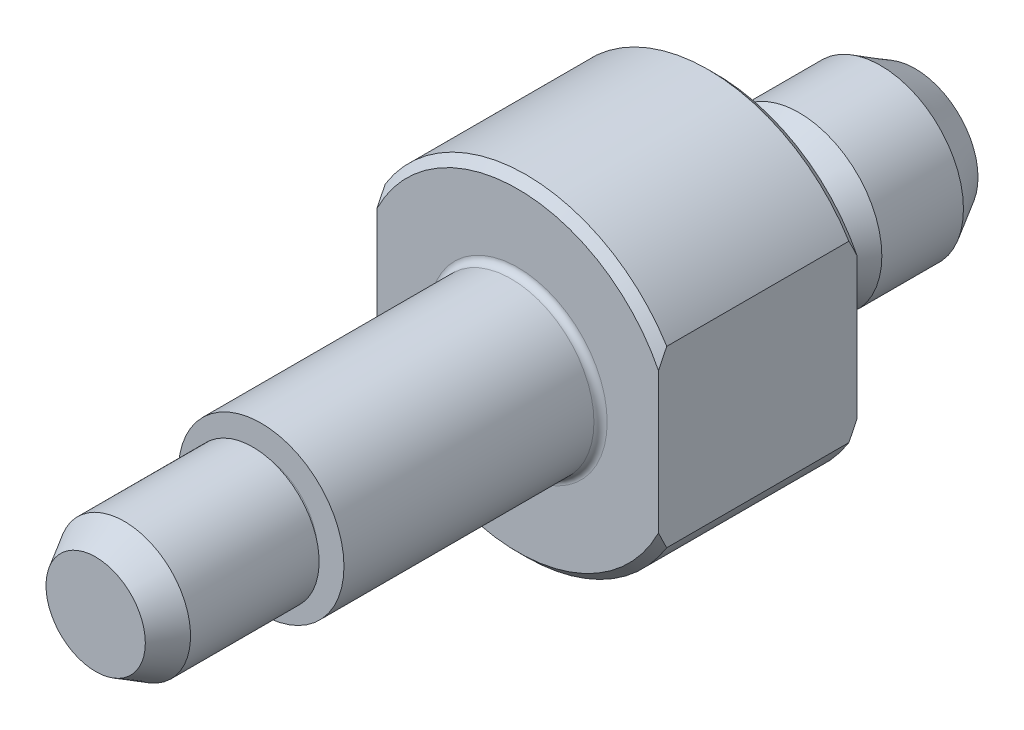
ISO-10303-21;
HEADER;
FILE_DESCRIPTION(('STEP AP214'),'2;1');
FILE_NAME('part.step','',(''),(''),'','','');
FILE_SCHEMA(('AUTOMOTIVE_DESIGN { 1 0 10303 214 1 1 1 1 }'));
ENDSEC;
DATA;
#1=APPLICATION_CONTEXT('core data for automotive mechanical design processes');
#2=APPLICATION_PROTOCOL_DEFINITION('international standard','automotive_design',2000,#1);
#3=PRODUCT_CONTEXT('',#1,'mechanical');
#4=PRODUCT('Part','Part','',(#3));
#5=PRODUCT_RELATED_PRODUCT_CATEGORY('part','',(#4));
#6=PRODUCT_DEFINITION_FORMATION('','',#4);
#7=PRODUCT_DEFINITION_CONTEXT('part definition',#1,'design');
#8=PRODUCT_DEFINITION('design','',#6,#7);
#9=PRODUCT_DEFINITION_SHAPE('','',#8);
#10=(LENGTH_UNIT() NAMED_UNIT(*) SI_UNIT(.MILLI.,.METRE.));
#11=(NAMED_UNIT(*) PLANE_ANGLE_UNIT() SI_UNIT($,.RADIAN.));
#12=(NAMED_UNIT(*) SI_UNIT($,.STERADIAN.) SOLID_ANGLE_UNIT());
#13=UNCERTAINTY_MEASURE_WITH_UNIT(LENGTH_MEASURE(1.E-05),#10,'distance_accuracy_value','');
#14=(GEOMETRIC_REPRESENTATION_CONTEXT(3) GLOBAL_UNCERTAINTY_ASSIGNED_CONTEXT((#13)) GLOBAL_UNIT_ASSIGNED_CONTEXT((#10,
#11,#12)) REPRESENTATION_CONTEXT('',''));
#15=CARTESIAN_POINT('',(0.,0.,0.));
#16=DIRECTION('',(0.,0.,1.));
#17=DIRECTION('',(1.,0.,0.));
#18=AXIS2_PLACEMENT_3D('',#15,#16,#17);
#19=CARTESIAN_POINT('',(0.,4.25000000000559,0.));
#20=DIRECTION('',(0.,0.,1.));
#21=DIRECTION('',(1.,0.,0.));
#22=AXIS2_PLACEMENT_3D('',#19,#20,#21);
#23=PLANE('',#22);
#24=CARTESIAN_POINT('',(0.,0.,0.));
#25=DIRECTION('',(0.,0.,1.));
#26=DIRECTION('',(1.,0.,0.));
#27=AXIS2_PLACEMENT_3D('',#24,#25,#26);
#28=CIRCLE('',#27,4.25000000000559);
#29=CARTESIAN_POINT('',(4.25000000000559,0.,0.));
#30=VERTEX_POINT('',#29);
#31=EDGE_CURVE('E114',#30,#30,#28,.T.);
#32=ORIENTED_EDGE('',*,*,#31,.T.);
#33=EDGE_LOOP('',(#32));
#34=FACE_BOUND('',#33,.T.);
#35=DIRECTION('',(0.,1.,0.));
#36=VECTOR('',#35,1.);
#37=CARTESIAN_POINT('',(-8.5,5.26782687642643,0.));
#38=LINE('',#37,#36);
#39=CARTESIAN_POINT('',(-8.5,-4.24264068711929,0.));
#40=VERTEX_POINT('',#39);
#41=CARTESIAN_POINT('',(-8.5,4.24264068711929,0.));
#42=VERTEX_POINT('',#41);
#43=EDGE_CURVE('E151',#40,#42,#38,.T.);
#44=ORIENTED_EDGE('',*,*,#43,.T.);
#45=CARTESIAN_POINT('',(0.,0.,0.));
#46=DIRECTION('',(0.,0.,1.));
#47=DIRECTION('',(1.,0.,0.));
#48=AXIS2_PLACEMENT_3D('',#45,#46,#47);
#49=CIRCLE('',#48,9.5);
#50=CARTESIAN_POINT('',(8.5,4.24264068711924,0.));
#51=VERTEX_POINT('',#50);
#52=EDGE_CURVE('E111',#51,#42,#49,.T.);
#53=ORIENTED_EDGE('',*,*,#52,.F.);
#54=DIRECTION('',(0.,-1.,0.));
#55=VECTOR('',#54,1.);
#56=CARTESIAN_POINT('',(8.5,5.26782687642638,0.));
#57=LINE('',#56,#55);
#58=CARTESIAN_POINT('',(8.5,-4.24264068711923,0.));
#59=VERTEX_POINT('',#58);
#60=EDGE_CURVE('E156',#51,#59,#57,.T.);
#61=ORIENTED_EDGE('',*,*,#60,.T.);
#62=EDGE_CURVE('E110',#40,#59,#49,.T.);
#63=ORIENTED_EDGE('',*,*,#62,.F.);
#64=EDGE_LOOP('',(#44,#53,#61,#63));
#65=FACE_BOUND('',#64,.T.);
#66=ADVANCED_FACE('F14',(#34,#65),#23,.F.);
#67=CARTESIAN_POINT('',(0.,0.,0.));
#68=DIRECTION('',(0.,0.,1.));
#69=DIRECTION('',(1.,0.,0.));
#70=AXIS2_PLACEMENT_3D('',#67,#68,#69);
#71=CONICAL_SURFACE('',#70,9.5,0.785398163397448);
#72=CARTESIAN_POINT('',(-8.5,-0.37272096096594,-0.991832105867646));
#73=CARTESIAN_POINT('',(-8.5,-0.507917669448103,-0.985925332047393));
#74=CARTESIAN_POINT('',(-8.5,-0.642962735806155,-0.976777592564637));
#75=CARTESIAN_POINT('',(-8.5,-0.912452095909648,-0.952214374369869));
#76=CARTESIAN_POINT('',(-8.5,-1.04689651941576,-0.936800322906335));
#77=CARTESIAN_POINT('',(-8.5,-1.31472326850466,-0.899946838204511));
#78=CARTESIAN_POINT('',(-8.5,-1.44810700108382,-0.878517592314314));
#79=CARTESIAN_POINT('',(-8.5,-1.7138236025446,-0.829929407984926));
#80=CARTESIAN_POINT('',(-8.5,-1.8461564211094,-0.802770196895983));
#81=CARTESIAN_POINT('',(-8.5,-2.23843819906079,-0.713859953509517));
#82=CARTESIAN_POINT('',(-8.5,-2.49663193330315,-0.644254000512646));
#83=CARTESIAN_POINT('',(-8.5,-3.00738161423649,-0.486941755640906));
#84=CARTESIAN_POINT('',(-8.5,-3.25993706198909,-0.399233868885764));
#85=CARTESIAN_POINT('',(-8.5,-3.60633087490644,-0.267035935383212));
#86=CARTESIAN_POINT('',(-8.5,-3.70267067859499,-0.228964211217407));
#87=CARTESIAN_POINT('',(-8.5,-3.84660031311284,-0.170240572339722));
#88=CARTESIAN_POINT('',(-8.5,-3.89451322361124,-0.150382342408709));
#89=CARTESIAN_POINT('',(-8.5,-3.9901211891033,-0.110155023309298));
#90=CARTESIAN_POINT('',(-8.5,-4.03781625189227,-0.0897859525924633));
#91=CARTESIAN_POINT('',(-8.5,-4.41902106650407,0.0753473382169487));
#92=CARTESIAN_POINT('',(-8.5,-4.74745851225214,0.231964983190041));
#93=CARTESIAN_POINT('',(-8.5,-5.39492011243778,0.563687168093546));
#94=CARTESIAN_POINT('',(-8.5,-5.71393853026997,0.738802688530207));
#95=CARTESIAN_POINT('',(-8.5,-6.34473897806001,1.10374280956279));
#96=CARTESIAN_POINT('',(-8.5,-6.65649518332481,1.29361180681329));
#97=CARTESIAN_POINT('',(-8.5,-7.27292769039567,1.68430487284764));
#98=CARTESIAN_POINT('',(-8.5,-7.57760543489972,1.88512668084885));
#99=CARTESIAN_POINT('',(-8.5,-8.17594813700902,2.29189718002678));
#100=CARTESIAN_POINT('',(-8.5,-8.46971226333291,2.49770061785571));
#101=CARTESIAN_POINT('',(-8.5,-9.05248286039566,2.91597018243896));
#102=CARTESIAN_POINT('',(-8.5,-9.34148890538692,3.12843690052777));
#103=CARTESIAN_POINT('',(-8.5,-9.91326520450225,3.5570756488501));
#104=CARTESIAN_POINT('',(-8.5,-10.1960663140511,3.77320664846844));
#105=CARTESIAN_POINT('',(-8.5,-10.7582100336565,4.20978238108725));
#106=CARTESIAN_POINT('',(-8.5,-11.0375534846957,4.43022603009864));
#107=CARTESIAN_POINT('',(-8.5,-11.3154929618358,4.6523984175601));
#108=B_SPLINE_CURVE_WITH_KNOTS('',3,(#72,#73,#74,#75,#76,#77,#78,#79,#80,#81,#82,#83,#84,#85,
#86,#87,#88,#89,#90,#91,#92,#93,#94,#95,#96,#97,#98,#99,#100,#101,#102,#103,#104,#105,#106,
#107),.UNSPECIFIED.,.F.,.F.,(4,2,2,2,2,2,2,2,2,2,2,2,2,2,2,2,2,4),(0.,0.405923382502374,
0.811754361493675,1.21690212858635,1.62206917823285,2.42345745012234,3.22491635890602,
3.53566783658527,3.69125965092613,3.84684585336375,4.93754201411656,6.02888929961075,
7.12365834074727,8.21820225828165,9.2941335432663,10.3701605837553,11.4379172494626,
12.5054088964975),.UNSPECIFIED.);
#109=CARTESIAN_POINT('',(-8.5,-5.26782687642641,0.5));
#110=VERTEX_POINT('',#109);
#111=EDGE_CURVE('E221',#40,#110,#108,.T.);
#112=ORIENTED_EDGE('',*,*,#111,.F.);
#113=ORIENTED_EDGE('',*,*,#62,.T.);
#114=CARTESIAN_POINT('',(8.5,-11.3154929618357,4.65239841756));
#115=CARTESIAN_POINT('',(8.5,-11.0292849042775,4.42362208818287));
#116=CARTESIAN_POINT('',(8.5,-10.7415906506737,4.19667337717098));
#117=CARTESIAN_POINT('',(8.5,-10.1625129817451,3.74737138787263));
#118=CARTESIAN_POINT('',(8.5,-9.8711285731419,3.52501939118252));
#119=CARTESIAN_POINT('',(8.5,-9.28190231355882,3.08432639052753));
#120=CARTESIAN_POINT('',(8.5,-8.98402837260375,2.86602815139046));
#121=CARTESIAN_POINT('',(8.5,-8.38316011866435,2.4366308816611));
#122=CARTESIAN_POINT('',(8.5,-8.08016629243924,2.22553117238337));
#123=CARTESIAN_POINT('',(8.5,-7.48054690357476,1.82085054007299));
#124=CARTESIAN_POINT('',(8.5,-7.18416758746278,1.62690623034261));
#125=CARTESIAN_POINT('',(8.5,-6.58465546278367,1.24957630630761));
#126=CARTESIAN_POINT('',(8.5,-6.28152157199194,1.06619240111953));
#127=CARTESIAN_POINT('',(8.5,-5.6681595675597,0.713482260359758));
#128=CARTESIAN_POINT('',(8.5,-5.35795159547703,0.544121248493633));
#129=CARTESIAN_POINT('',(8.5,-4.72861850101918,0.222995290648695));
#130=CARTESIAN_POINT('',(8.5,-4.40949735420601,0.0712226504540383));
#131=CARTESIAN_POINT('',(8.5,-3.79382756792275,-0.195479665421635));
#132=CARTESIAN_POINT('',(8.5,-3.49822614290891,-0.312577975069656));
#133=CARTESIAN_POINT('',(8.5,-2.89897602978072,-0.523606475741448));
#134=CARTESIAN_POINT('',(8.5,-2.59533481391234,-0.617557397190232));
#135=CARTESIAN_POINT('',(8.5,-2.13179685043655,-0.738050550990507));
#136=CARTESIAN_POINT('',(8.5,-1.97458059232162,-0.775031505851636));
#137=CARTESIAN_POINT('',(8.5,-1.65849610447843,-0.841089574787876));
#138=CARTESIAN_POINT('',(8.5,-1.49962804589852,-0.870167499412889));
#139=CARTESIAN_POINT('',(8.5,-1.17994467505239,-0.919948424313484));
#140=CARTESIAN_POINT('',(8.5,-1.01912419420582,-0.940618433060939));
#141=CARTESIAN_POINT('',(8.5,-0.696518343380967,-0.973029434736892));
#142=CARTESIAN_POINT('',(8.5,-0.534732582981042,-0.984766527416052));
#143=CARTESIAN_POINT('',(8.5,-0.372720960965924,-0.991832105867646));
#144=B_SPLINE_CURVE_WITH_KNOTS('',3,(#114,#115,#116,#117,#118,#119,#120,#121,#122,#123,#124,
#125,#126,#127,#128,#129,#130,#131,#132,#133,#134,#135,#136,#137,#138,#139,#140,#141,#142,#143),
.UNSPECIFIED.,.F.,.F.,(4,2,2,2,2,2,2,2,2,2,2,2,2,2,4),(0.,1.09924125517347,2.19878496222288,
3.30660143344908,4.41431316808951,5.47672807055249,6.53931443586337,7.5991813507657,
8.65858285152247,9.61170467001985,10.5639697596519,11.0483221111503,11.5326247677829,
12.0188098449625,12.5052070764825),.UNSPECIFIED.);
#145=CARTESIAN_POINT('',(8.5,-5.26782687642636,0.5));
#146=VERTEX_POINT('',#145);
#147=EDGE_CURVE('E197',#146,#59,#144,.T.);
#148=ORIENTED_EDGE('',*,*,#147,.F.);
#149=CARTESIAN_POINT('',(0.,0.,0.5));
#150=DIRECTION('',(0.,0.,1.));
#151=DIRECTION('',(1.,0.,0.));
#152=AXIS2_PLACEMENT_3D('',#149,#150,#151);
#153=CIRCLE('',#152,10.);
#154=EDGE_CURVE('E94',#110,#146,#153,.T.);
#155=ORIENTED_EDGE('',*,*,#154,.F.);
#156=EDGE_LOOP('',(#112,#113,#148,#155));
#157=FACE_BOUND('',#156,.T.);
#158=ADVANCED_FACE('F203',(#157),#71,.T.);
#159=CARTESIAN_POINT('',(-8.5,11.3154929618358,4.6523984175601));
#160=CARTESIAN_POINT('',(-8.5,11.0292849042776,4.42362208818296));
#161=CARTESIAN_POINT('',(-8.5,10.7415906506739,4.19667337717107));
#162=CARTESIAN_POINT('',(-8.5,10.1625129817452,3.74737138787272));
#163=CARTESIAN_POINT('',(-8.5,9.871128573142,3.5250193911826));
#164=CARTESIAN_POINT('',(-8.5,9.28190231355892,3.08432639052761));
#165=CARTESIAN_POINT('',(-8.5,8.98402837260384,2.86602815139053));
#166=CARTESIAN_POINT('',(-8.5,8.38316011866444,2.43663088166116));
#167=CARTESIAN_POINT('',(-8.5,8.08016629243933,2.22553117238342));
#168=CARTESIAN_POINT('',(-8.5,7.48054690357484,1.82085054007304));
#169=CARTESIAN_POINT('',(-8.5,7.18416758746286,1.62690623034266));
#170=CARTESIAN_POINT('',(-8.5,6.58465546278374,1.24957630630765));
#171=CARTESIAN_POINT('',(-8.5,6.281521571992,1.06619240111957));
#172=CARTESIAN_POINT('',(-8.5,5.66815956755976,0.71348226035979));
#173=CARTESIAN_POINT('',(-8.5,5.35795159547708,0.544121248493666));
#174=CARTESIAN_POINT('',(-8.5,4.72861850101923,0.222995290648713));
#175=CARTESIAN_POINT('',(-8.5,4.40949735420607,0.0712226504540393));
#176=CARTESIAN_POINT('',(-8.5,3.7938275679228,-0.195479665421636));
#177=CARTESIAN_POINT('',(-8.5,3.49822614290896,-0.312577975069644));
#178=CARTESIAN_POINT('',(-8.5,2.89897602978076,-0.52360647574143));
#179=CARTESIAN_POINT('',(-8.5,2.59533481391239,-0.617557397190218));
#180=CARTESIAN_POINT('',(-8.5,2.13179685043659,-0.738050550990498));
#181=CARTESIAN_POINT('',(-8.5,1.97458059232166,-0.775031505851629));
#182=CARTESIAN_POINT('',(-8.5,1.65849610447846,-0.841089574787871));
#183=CARTESIAN_POINT('',(-8.5,1.49962804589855,-0.870167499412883));
#184=CARTESIAN_POINT('',(-8.5,1.17994467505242,-0.919948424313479));
#185=CARTESIAN_POINT('',(-8.5,1.01912419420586,-0.940618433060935));
#186=CARTESIAN_POINT('',(-8.5,0.696518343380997,-0.973029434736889));
#187=CARTESIAN_POINT('',(-8.5,0.534732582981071,-0.98476652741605));
#188=CARTESIAN_POINT('',(-8.5,0.372720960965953,-0.991832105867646));
#189=B_SPLINE_CURVE_WITH_KNOTS('',3,(#159,#160,#161,#162,#163,#164,#165,#166,#167,#168,#169,
#170,#171,#172,#173,#174,#175,#176,#177,#178,#179,#180,#181,#182,#183,#184,#185,#186,#187,#188),
.UNSPECIFIED.,.F.,.F.,(4,2,2,2,2,2,2,2,2,2,2,2,2,2,4),(0.,1.09924125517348,2.19878496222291,
3.30660143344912,4.41431316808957,5.47672807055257,6.53931443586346,7.5991813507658,
8.65858285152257,9.61170467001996,10.5639697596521,11.0483221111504,11.532624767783,
12.0188098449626,12.5052070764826),.UNSPECIFIED.);
#190=CARTESIAN_POINT('',(-8.5,5.26782687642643,0.5));
#191=VERTEX_POINT('',#190);
#192=EDGE_CURVE('E215',#191,#42,#189,.T.);
#193=ORIENTED_EDGE('',*,*,#192,.F.);
#194=CARTESIAN_POINT('',(8.5,5.26782687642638,0.5));
#195=VERTEX_POINT('',#194);
#196=EDGE_CURVE('E107',#195,#191,#153,.T.);
#197=ORIENTED_EDGE('',*,*,#196,.F.);
#198=CARTESIAN_POINT('',(8.5,0.37272096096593,-0.991832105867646));
#199=CARTESIAN_POINT('',(8.5,0.507917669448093,-0.985925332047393));
#200=CARTESIAN_POINT('',(8.5,0.642962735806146,-0.976777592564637));
#201=CARTESIAN_POINT('',(8.5,0.912452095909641,-0.952214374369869));
#202=CARTESIAN_POINT('',(8.5,1.04689651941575,-0.936800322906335));
#203=CARTESIAN_POINT('',(8.5,1.31472326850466,-0.899946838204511));
#204=CARTESIAN_POINT('',(8.5,1.44810700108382,-0.878517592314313));
#205=CARTESIAN_POINT('',(8.5,1.71382360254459,-0.829929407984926));
#206=CARTESIAN_POINT('',(8.5,1.8461564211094,-0.802770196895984));
#207=CARTESIAN_POINT('',(8.5,2.23843819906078,-0.71385995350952));
#208=CARTESIAN_POINT('',(8.5,2.49663193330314,-0.644254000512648));
#209=CARTESIAN_POINT('',(8.5,3.00738161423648,-0.486941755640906));
#210=CARTESIAN_POINT('',(8.5,3.25993706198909,-0.399233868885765));
#211=CARTESIAN_POINT('',(8.5,3.60633087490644,-0.267035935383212));
#212=CARTESIAN_POINT('',(8.5,3.70267067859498,-0.228964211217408));
#213=CARTESIAN_POINT('',(8.5,3.84660031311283,-0.170240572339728));
#214=CARTESIAN_POINT('',(8.5,3.89451322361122,-0.150382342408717));
#215=CARTESIAN_POINT('',(8.5,3.99012118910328,-0.110155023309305));
#216=CARTESIAN_POINT('',(8.5,4.03781625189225,-0.0897859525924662));
#217=CARTESIAN_POINT('',(8.5,4.41902106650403,0.0753473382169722));
#218=CARTESIAN_POINT('',(8.5,4.74745851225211,0.23196498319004));
#219=CARTESIAN_POINT('',(8.5,5.39492011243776,0.563687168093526));
#220=CARTESIAN_POINT('',(8.5,5.71393853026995,0.738802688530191));
#221=CARTESIAN_POINT('',(8.5,6.34473897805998,1.10374280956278));
#222=CARTESIAN_POINT('',(8.5,6.65649518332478,1.29361180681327));
#223=CARTESIAN_POINT('',(8.5,7.27292769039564,1.68430487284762));
#224=CARTESIAN_POINT('',(8.5,7.57760543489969,1.88512668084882));
#225=CARTESIAN_POINT('',(8.5,8.17594813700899,2.29189718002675));
#226=CARTESIAN_POINT('',(8.5,8.46971226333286,2.49770061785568));
#227=CARTESIAN_POINT('',(8.5,9.05248286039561,2.91597018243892));
#228=CARTESIAN_POINT('',(8.5,9.34148890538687,3.12843690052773));
#229=CARTESIAN_POINT('',(8.5,9.91326520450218,3.55707564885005));
#230=CARTESIAN_POINT('',(8.5,10.1960663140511,3.77320664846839));
#231=CARTESIAN_POINT('',(8.5,10.7582100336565,4.20978238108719));
#232=CARTESIAN_POINT('',(8.5,11.0375534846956,4.43022603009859));
#233=CARTESIAN_POINT('',(8.5,11.3154929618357,4.65239841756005));
#234=B_SPLINE_CURVE_WITH_KNOTS('',3,(#198,#199,#200,#201,#202,#203,#204,#205,#206,#207,#208,
#209,#210,#211,#212,#213,#214,#215,#216,#217,#218,#219,#220,#221,#222,#223,#224,#225,#226,#227,
#228,#229,#230,#231,#232,#233),.UNSPECIFIED.,.F.,.F.,(4,2,2,2,2,2,2,2,2,2,2,2,2,2,2,2,2,4),(0.,
0.405923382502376,0.81175436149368,1.21690212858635,1.62206917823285,2.42345745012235,
3.22491635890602,3.53566783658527,3.69125965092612,3.84684585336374,4.93754201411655,
6.02888929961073,7.12365834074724,8.21820225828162,9.29413354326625,10.3701605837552,
11.4379172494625,12.5054088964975),.UNSPECIFIED.);
#235=EDGE_CURVE('E85',#51,#195,#234,.T.);
#236=ORIENTED_EDGE('',*,*,#235,.F.);
#237=ORIENTED_EDGE('',*,*,#52,.T.);
#238=EDGE_LOOP('',(#193,#197,#236,#237));
#239=FACE_BOUND('',#238,.T.);
#240=ADVANCED_FACE('F207',(#239),#71,.T.);
#241=CARTESIAN_POINT('',(0.,0.,37.5));
#242=DIRECTION('',(0.,0.,1.));
#243=DIRECTION('',(1.,0.,0.));
#244=AXIS2_PLACEMENT_3D('',#241,#242,#243);
#245=CYLINDRICAL_SURFACE('',#244,10.);
#246=DIRECTION('',(0.,0.,-1.));
#247=VECTOR('',#246,1.);
#248=CARTESIAN_POINT('',(-8.5,-5.26782687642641,38.2488094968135));
#249=LINE('',#248,#247);
#250=CARTESIAN_POINT('',(-8.5,-5.26782687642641,11.5));
#251=VERTEX_POINT('',#250);
#252=EDGE_CURVE('E158',#251,#110,#249,.T.);
#253=ORIENTED_EDGE('',*,*,#252,.T.);
#254=ORIENTED_EDGE('',*,*,#154,.T.);
#255=DIRECTION('',(0.,0.,-1.));
#256=VECTOR('',#255,1.);
#257=CARTESIAN_POINT('',(8.5,-5.26782687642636,38.2488094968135));
#258=LINE('',#257,#256);
#259=CARTESIAN_POINT('',(8.5,-5.26782687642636,11.5));
#260=VERTEX_POINT('',#259);
#261=EDGE_CURVE('E79',#260,#146,#258,.T.);
#262=ORIENTED_EDGE('',*,*,#261,.F.);
#263=CARTESIAN_POINT('',(0.,0.,11.5));
#264=DIRECTION('',(0.,0.,1.));
#265=DIRECTION('',(1.,0.,0.));
#266=AXIS2_PLACEMENT_3D('',#263,#264,#265);
#267=CIRCLE('',#266,10.);
#268=EDGE_CURVE('E92',#251,#260,#267,.T.);
#269=ORIENTED_EDGE('',*,*,#268,.F.);
#270=EDGE_LOOP('',(#253,#254,#262,#269));
#271=FACE_BOUND('',#270,.T.);
#272=ADVANCED_FACE('F91',(#271),#245,.T.);
#273=DIRECTION('',(0.,0.,-1.));
#274=VECTOR('',#273,1.);
#275=CARTESIAN_POINT('',(-8.5,5.26782687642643,38.2488094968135));
#276=LINE('',#275,#274);
#277=CARTESIAN_POINT('',(-8.5,5.26782687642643,11.5));
#278=VERTEX_POINT('',#277);
#279=EDGE_CURVE('E162',#278,#191,#276,.T.);
#280=ORIENTED_EDGE('',*,*,#279,.F.);
#281=CARTESIAN_POINT('',(8.5,5.26782687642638,11.5));
#282=VERTEX_POINT('',#281);
#283=EDGE_CURVE('E98',#282,#278,#267,.T.);
#284=ORIENTED_EDGE('',*,*,#283,.F.);
#285=DIRECTION('',(0.,0.,-1.));
#286=VECTOR('',#285,1.);
#287=CARTESIAN_POINT('',(8.5,5.26782687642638,38.2488094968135));
#288=LINE('',#287,#286);
#289=EDGE_CURVE('E95',#282,#195,#288,.T.);
#290=ORIENTED_EDGE('',*,*,#289,.T.);
#291=ORIENTED_EDGE('',*,*,#196,.T.);
#292=EDGE_LOOP('',(#280,#284,#290,#291));
#293=FACE_BOUND('',#292,.T.);
#294=ADVANCED_FACE('F272',(#293),#245,.T.);
#295=CARTESIAN_POINT('',(0.,0.,11.5));
#296=DIRECTION('',(0.,0.,-1.));
#297=DIRECTION('',(-1.,0.,0.));
#298=AXIS2_PLACEMENT_3D('',#295,#296,#297);
#299=CONICAL_SURFACE('',#298,10.,0.785398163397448);
#300=CARTESIAN_POINT('',(-8.5,-11.3154929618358,7.3476015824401));
#301=CARTESIAN_POINT('',(-8.5,-11.0292849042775,7.57637791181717));
#302=CARTESIAN_POINT('',(-8.5,-10.7415906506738,7.80332662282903));
#303=CARTESIAN_POINT('',(-8.5,-10.1625129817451,8.25262861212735));
#304=CARTESIAN_POINT('',(-8.5,-9.87112857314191,8.47498060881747));
#305=CARTESIAN_POINT('',(-8.5,-9.28190231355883,8.91567360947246));
#306=CARTESIAN_POINT('',(-8.5,-8.98402837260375,9.13397184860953));
#307=CARTESIAN_POINT('',(-8.5,-8.38316011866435,9.56336911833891));
#308=CARTESIAN_POINT('',(-8.5,-8.08016629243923,9.77446882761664));
#309=CARTESIAN_POINT('',(-8.5,-7.48054690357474,10.179149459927));
#310=CARTESIAN_POINT('',(-8.5,-7.18416758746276,10.3730937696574));
#311=CARTESIAN_POINT('',(-8.5,-6.58465546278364,10.7504236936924));
#312=CARTESIAN_POINT('',(-8.5,-6.28152157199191,10.9338075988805));
#313=CARTESIAN_POINT('',(-8.5,-5.66815956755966,11.2865177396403));
#314=CARTESIAN_POINT('',(-8.5,-5.35795159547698,11.4558787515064));
#315=CARTESIAN_POINT('',(-8.5,-4.72861850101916,11.7770047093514));
#316=CARTESIAN_POINT('',(-8.5,-4.40949735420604,11.9287773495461));
#317=CARTESIAN_POINT('',(-8.5,-3.79382756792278,12.1954796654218));
#318=CARTESIAN_POINT('',(-8.5,-3.49822614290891,12.3125779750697));
#319=CARTESIAN_POINT('',(-8.5,-2.8989760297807,12.5236064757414));
#320=CARTESIAN_POINT('',(-8.5,-2.59533481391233,12.6175573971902));
#321=CARTESIAN_POINT('',(-8.5,-2.13179685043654,12.7380505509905));
#322=CARTESIAN_POINT('',(-8.5,-1.97458059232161,12.7750315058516));
#323=CARTESIAN_POINT('',(-8.5,-1.65849610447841,12.8410895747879));
#324=CARTESIAN_POINT('',(-8.5,-1.4996280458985,12.8701674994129));
#325=CARTESIAN_POINT('',(-8.5,-1.17994467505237,12.9199484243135));
#326=CARTESIAN_POINT('',(-8.5,-1.01912419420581,12.9406184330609));
#327=CARTESIAN_POINT('',(-8.5,-0.696518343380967,12.9730294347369));
#328=CARTESIAN_POINT('',(-8.5,-0.53473258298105,12.9847665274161));
#329=CARTESIAN_POINT('',(-8.5,-0.372720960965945,12.9918321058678));
#330=B_SPLINE_CURVE_WITH_KNOTS('',3,(#300,#301,#302,#303,#304,#305,#306,#307,#308,#309,#310,
#311,#312,#313,#314,#315,#316,#317,#318,#319,#320,#321,#322,#323,#324,#325,#326,#327,#328,#329),
.UNSPECIFIED.,.F.,.F.,(4,2,2,2,2,2,2,2,2,2,2,2,2,2,4),(0.,1.09924125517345,2.19878496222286,
3.30660143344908,4.41431316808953,5.47672807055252,6.53931443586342,7.59918135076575,
8.6585828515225,9.61170467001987,10.563969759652,11.0483221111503,11.5326247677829,
12.0188098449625,12.5052070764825),.UNSPECIFIED.);
#331=CARTESIAN_POINT('',(-8.5,-4.24264068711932,12.));
#332=VERTEX_POINT('',#331);
#333=EDGE_CURVE('E28',#251,#332,#330,.T.);
#334=ORIENTED_EDGE('',*,*,#333,.F.);
#335=ORIENTED_EDGE('',*,*,#268,.T.);
#336=CARTESIAN_POINT('',(8.5,-0.372720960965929,12.9918321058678));
#337=CARTESIAN_POINT('',(8.5,-0.507917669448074,12.9859253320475));
#338=CARTESIAN_POINT('',(8.5,-0.642962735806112,12.9767775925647));
#339=CARTESIAN_POINT('',(8.5,-0.912452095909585,12.9522143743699));
#340=CARTESIAN_POINT('',(8.5,-1.04689651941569,12.9368003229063));
#341=CARTESIAN_POINT('',(8.5,-1.31472326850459,12.8999468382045));
#342=CARTESIAN_POINT('',(8.5,-1.44810700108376,12.8785175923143));
#343=CARTESIAN_POINT('',(8.5,-1.71382360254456,12.8299294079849));
#344=CARTESIAN_POINT('',(8.5,-1.84615642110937,12.802770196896));
#345=CARTESIAN_POINT('',(8.5,-2.23843819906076,12.7138599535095));
#346=CARTESIAN_POINT('',(8.5,-2.49663193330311,12.6442540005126));
#347=CARTESIAN_POINT('',(8.5,-3.00738161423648,12.486941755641));
#348=CARTESIAN_POINT('',(8.5,-3.25993706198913,12.399233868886));
#349=CARTESIAN_POINT('',(8.5,-3.60633087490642,12.2670359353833));
#350=CARTESIAN_POINT('',(8.5,-3.70267067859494,12.2289642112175));
#351=CARTESIAN_POINT('',(8.5,-3.84660031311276,12.1702405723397));
#352=CARTESIAN_POINT('',(8.5,-3.89451322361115,12.1503823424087));
#353=CARTESIAN_POINT('',(8.5,-3.99012118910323,12.1101550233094));
#354=CARTESIAN_POINT('',(8.5,-4.03781625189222,12.0897859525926));
#355=CARTESIAN_POINT('',(8.5,-4.41902106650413,11.9246526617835));
#356=CARTESIAN_POINT('',(8.5,-4.74745851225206,11.7680350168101));
#357=CARTESIAN_POINT('',(8.5,-5.3949201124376,11.4363128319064));
#358=CARTESIAN_POINT('',(8.5,-5.71393853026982,11.2611973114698));
#359=CARTESIAN_POINT('',(8.5,-6.34473897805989,10.8962571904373));
#360=CARTESIAN_POINT('',(8.5,-6.6564951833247,10.7063881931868));
#361=CARTESIAN_POINT('',(8.5,-7.27292769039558,10.3156951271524));
#362=CARTESIAN_POINT('',(8.5,-7.57760543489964,10.1148733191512));
#363=CARTESIAN_POINT('',(8.5,-8.17594813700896,9.70810281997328));
#364=CARTESIAN_POINT('',(8.5,-8.46971226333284,9.50229938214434));
#365=CARTESIAN_POINT('',(8.5,-9.05248286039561,9.08402981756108));
#366=CARTESIAN_POINT('',(8.5,-9.34148890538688,8.87156309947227));
#367=CARTESIAN_POINT('',(8.5,-9.91326520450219,8.44292435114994));
#368=CARTESIAN_POINT('',(8.5,-10.1960663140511,8.22679335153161));
#369=CARTESIAN_POINT('',(8.5,-10.7582100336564,7.79021761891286));
#370=CARTESIAN_POINT('',(8.5,-11.0375534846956,7.56977396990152));
#371=CARTESIAN_POINT('',(8.5,-11.3154929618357,7.34760158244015));
#372=B_SPLINE_CURVE_WITH_KNOTS('',3,(#336,#337,#338,#339,#340,#341,#342,#343,#344,#345,#346,
#347,#348,#349,#350,#351,#352,#353,#354,#355,#356,#357,#358,#359,#360,#361,#362,#363,#364,#365,
#366,#367,#368,#369,#370,#371),.UNSPECIFIED.,.F.,.F.,(4,2,2,2,2,2,2,2,2,2,2,2,2,2,2,2,2,4),(0.,
0.405923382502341,0.811754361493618,1.21690212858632,1.62206917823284,2.42345745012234,
3.22491635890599,3.53566783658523,3.69125965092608,3.84684585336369,4.93754201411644,
6.02888929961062,7.12365834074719,8.21820225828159,9.29413354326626,10.3701605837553,
11.4379172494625,12.5054088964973),.UNSPECIFIED.);
#373=CARTESIAN_POINT('',(8.5,-4.24264068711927,12.));
#374=VERTEX_POINT('',#373);
#375=EDGE_CURVE('E76',#374,#260,#372,.T.);
#376=ORIENTED_EDGE('',*,*,#375,.F.);
#377=CARTESIAN_POINT('',(0.,0.,12.));
#378=DIRECTION('',(0.,0.,1.));
#379=DIRECTION('',(1.,0.,0.));
#380=AXIS2_PLACEMENT_3D('',#377,#378,#379);
#381=CIRCLE('',#380,9.5);
#382=EDGE_CURVE('E103',#332,#374,#381,.T.);
#383=ORIENTED_EDGE('',*,*,#382,.F.);
#384=EDGE_LOOP('',(#334,#335,#376,#383));
#385=FACE_BOUND('',#384,.T.);
#386=ADVANCED_FACE('F97',(#385),#299,.T.);
#387=CARTESIAN_POINT('',(-8.5,0.372720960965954,12.9918321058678));
#388=CARTESIAN_POINT('',(-8.5,0.507917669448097,12.9859253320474));
#389=CARTESIAN_POINT('',(-8.5,0.642962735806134,12.9767775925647));
#390=CARTESIAN_POINT('',(-8.5,0.912452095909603,12.9522143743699));
#391=CARTESIAN_POINT('',(-8.5,1.0468965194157,12.9368003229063));
#392=CARTESIAN_POINT('',(-8.5,1.31472326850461,12.8999468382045));
#393=CARTESIAN_POINT('',(-8.5,1.44810700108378,12.8785175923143));
#394=CARTESIAN_POINT('',(-8.5,1.71382360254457,12.8299294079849));
#395=CARTESIAN_POINT('',(-8.5,1.84615642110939,12.802770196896));
#396=CARTESIAN_POINT('',(-8.5,2.23843819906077,12.7138599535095));
#397=CARTESIAN_POINT('',(-8.5,2.49663193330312,12.6442540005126));
#398=CARTESIAN_POINT('',(-8.5,3.00738161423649,12.486941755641));
#399=CARTESIAN_POINT('',(-8.5,3.25993706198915,12.399233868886));
#400=CARTESIAN_POINT('',(-8.5,3.60633087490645,12.2670359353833));
#401=CARTESIAN_POINT('',(-8.5,3.70267067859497,12.2289642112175));
#402=CARTESIAN_POINT('',(-8.5,3.8466003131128,12.1702405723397));
#403=CARTESIAN_POINT('',(-8.5,3.89451322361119,12.1503823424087));
#404=CARTESIAN_POINT('',(-8.5,3.99012118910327,12.1101550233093));
#405=CARTESIAN_POINT('',(-8.5,4.03781625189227,12.0897859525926));
#406=CARTESIAN_POINT('',(-8.5,4.4190210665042,11.9246526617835));
#407=CARTESIAN_POINT('',(-8.5,4.74745851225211,11.7680350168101));
#408=CARTESIAN_POINT('',(-8.5,5.39492011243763,11.4363128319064));
#409=CARTESIAN_POINT('',(-8.5,5.71393853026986,11.2611973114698));
#410=CARTESIAN_POINT('',(-8.5,6.34473897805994,10.8962571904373));
#411=CARTESIAN_POINT('',(-8.5,6.65649518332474,10.7063881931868));
#412=CARTESIAN_POINT('',(-8.5,7.27292769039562,10.3156951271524));
#413=CARTESIAN_POINT('',(-8.5,7.57760543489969,10.1148733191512));
#414=CARTESIAN_POINT('',(-8.5,8.17594813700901,9.70810281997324));
#415=CARTESIAN_POINT('',(-8.5,8.46971226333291,9.50229938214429));
#416=CARTESIAN_POINT('',(-8.5,9.05248286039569,9.08402981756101));
#417=CARTESIAN_POINT('',(-8.5,9.34148890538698,8.8715630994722));
#418=CARTESIAN_POINT('',(-8.5,9.9132652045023,8.44292435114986));
#419=CARTESIAN_POINT('',(-8.5,10.1960663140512,8.22679335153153));
#420=CARTESIAN_POINT('',(-8.5,10.7582100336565,7.79021761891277));
#421=CARTESIAN_POINT('',(-8.5,11.0375534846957,7.56977396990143));
#422=CARTESIAN_POINT('',(-8.5,11.3154929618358,7.34760158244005));
#423=B_SPLINE_CURVE_WITH_KNOTS('',3,(#387,#388,#389,#390,#391,#392,#393,#394,#395,#396,#397,
#398,#399,#400,#401,#402,#403,#404,#405,#406,#407,#408,#409,#410,#411,#412,#413,#414,#415,#416,
#417,#418,#419,#420,#421,#422),.UNSPECIFIED.,.F.,.F.,(4,2,2,2,2,2,2,2,2,2,2,2,2,2,2,2,2,4),(0.,
0.405923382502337,0.811754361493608,1.21690212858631,1.62206917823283,2.42345745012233,
3.22491635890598,3.53566783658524,3.6912596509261,3.84684585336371,4.93754201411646,
6.02888929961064,7.12365834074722,8.21820225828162,9.29413354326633,10.3701605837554,
11.4379172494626,12.5054088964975),.UNSPECIFIED.);
#424=CARTESIAN_POINT('',(-8.5,4.24264068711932,12.));
#425=VERTEX_POINT('',#424);
#426=EDGE_CURVE('E253',#425,#278,#423,.T.);
#427=ORIENTED_EDGE('',*,*,#426,.F.);
#428=CARTESIAN_POINT('',(8.5,4.24264068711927,12.));
#429=VERTEX_POINT('',#428);
#430=EDGE_CURVE('E99',#429,#425,#381,.T.);
#431=ORIENTED_EDGE('',*,*,#430,.F.);
#432=CARTESIAN_POINT('',(8.5,11.3154929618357,7.3476015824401));
#433=CARTESIAN_POINT('',(8.5,11.0292849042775,7.57637791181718));
#434=CARTESIAN_POINT('',(8.5,10.7415906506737,7.80332662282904));
#435=CARTESIAN_POINT('',(8.5,10.1625129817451,8.25262861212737));
#436=CARTESIAN_POINT('',(8.5,9.87112857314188,8.47498060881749));
#437=CARTESIAN_POINT('',(8.5,9.28190231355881,8.91567360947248));
#438=CARTESIAN_POINT('',(8.5,8.98402837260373,9.13397184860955));
#439=CARTESIAN_POINT('',(8.5,8.38316011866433,9.56336911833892));
#440=CARTESIAN_POINT('',(8.5,8.08016629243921,9.77446882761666));
#441=CARTESIAN_POINT('',(8.5,7.48054690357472,10.179149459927));
#442=CARTESIAN_POINT('',(8.5,7.18416758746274,10.3730937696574));
#443=CARTESIAN_POINT('',(8.5,6.58465546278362,10.7504236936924));
#444=CARTESIAN_POINT('',(8.5,6.28152157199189,10.9338075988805));
#445=CARTESIAN_POINT('',(8.5,5.66815956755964,11.2865177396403));
#446=CARTESIAN_POINT('',(8.5,5.35795159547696,11.4558787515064));
#447=CARTESIAN_POINT('',(8.5,4.72861850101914,11.7770047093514));
#448=CARTESIAN_POINT('',(8.5,4.40949735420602,11.9287773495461));
#449=CARTESIAN_POINT('',(8.5,3.79382756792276,12.1954796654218));
#450=CARTESIAN_POINT('',(8.5,3.49822614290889,12.3125779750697));
#451=CARTESIAN_POINT('',(8.5,2.89897602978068,12.5236064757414));
#452=CARTESIAN_POINT('',(8.5,2.59533481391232,12.6175573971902));
#453=CARTESIAN_POINT('',(8.5,2.13179685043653,12.7380505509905));
#454=CARTESIAN_POINT('',(8.5,1.9745805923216,12.7750315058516));
#455=CARTESIAN_POINT('',(8.5,1.6584961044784,12.8410895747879));
#456=CARTESIAN_POINT('',(8.5,1.49962804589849,12.8701674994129));
#457=CARTESIAN_POINT('',(8.5,1.17994467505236,12.9199484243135));
#458=CARTESIAN_POINT('',(8.5,1.0191241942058,12.9406184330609));
#459=CARTESIAN_POINT('',(8.5,0.696518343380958,12.9730294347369));
#460=CARTESIAN_POINT('',(8.5,0.534732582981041,12.9847665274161));
#461=CARTESIAN_POINT('',(8.5,0.372720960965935,12.9918321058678));
#462=B_SPLINE_CURVE_WITH_KNOTS('',3,(#432,#433,#434,#435,#436,#437,#438,#439,#440,#441,#442,
#443,#444,#445,#446,#447,#448,#449,#450,#451,#452,#453,#454,#455,#456,#457,#458,#459,#460,#461),
.UNSPECIFIED.,.F.,.F.,(4,2,2,2,2,2,2,2,2,2,2,2,2,2,4),(0.,1.09924125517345,2.19878496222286,
3.30660143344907,4.41431316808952,5.47672807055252,6.5393144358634,7.59918135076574,
8.65858285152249,9.61170467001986,10.5639697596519,11.0483221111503,11.5326247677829,
12.0188098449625,12.5052070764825),.UNSPECIFIED.);
#463=EDGE_CURVE('E36',#282,#429,#462,.T.);
#464=ORIENTED_EDGE('',*,*,#463,.F.);
#465=ORIENTED_EDGE('',*,*,#283,.T.);
#466=EDGE_LOOP('',(#427,#431,#464,#465));
#467=FACE_BOUND('',#466,.T.);
#468=ADVANCED_FACE('F256',(#467),#299,.T.);
#469=CARTESIAN_POINT('',(0.,9.5,12.));
#470=DIRECTION('',(0.,0.,-1.));
#471=DIRECTION('',(-1.,0.,0.));
#472=AXIS2_PLACEMENT_3D('',#469,#470,#471);
#473=PLANE('',#472);
#474=CARTESIAN_POINT('',(0.,0.,12.));
#475=DIRECTION('',(0.,0.,1.));
#476=DIRECTION('',(1.,0.,0.));
#477=AXIS2_PLACEMENT_3D('',#474,#475,#476);
#478=CIRCLE('',#477,5.4);
#479=CARTESIAN_POINT('',(5.4,0.,12.));
#480=VERTEX_POINT('',#479);
#481=EDGE_CURVE('E245',#480,#480,#478,.T.);
#482=ORIENTED_EDGE('',*,*,#481,.F.);
#483=EDGE_LOOP('',(#482));
#484=FACE_BOUND('',#483,.T.);
#485=DIRECTION('',(0.,1.,0.));
#486=VECTOR('',#485,1.);
#487=CARTESIAN_POINT('',(-8.5,9.5,12.));
#488=LINE('',#487,#486);
#489=EDGE_CURVE('E9',#332,#425,#488,.T.);
#490=ORIENTED_EDGE('',*,*,#489,.F.);
#491=ORIENTED_EDGE('',*,*,#382,.T.);
#492=DIRECTION('',(0.,-1.,0.));
#493=VECTOR('',#492,1.);
#494=CARTESIAN_POINT('',(8.5,9.5,12.));
#495=LINE('',#494,#493);
#496=EDGE_CURVE('E22',#429,#374,#495,.T.);
#497=ORIENTED_EDGE('',*,*,#496,.F.);
#498=ORIENTED_EDGE('',*,*,#430,.T.);
#499=EDGE_LOOP('',(#490,#491,#497,#498));
#500=FACE_BOUND('',#499,.T.);
#501=ADVANCED_FACE('F250',(#484,#500),#473,.F.);
#502=CARTESIAN_POINT('',(0.,3.57735026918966,28.));
#503=DIRECTION('',(0.,0.,1.));
#504=DIRECTION('',(1.,0.,0.));
#505=AXIS2_PLACEMENT_3D('',#502,#503,#504);
#506=PLANE('',#505);
#507=CARTESIAN_POINT('',(0.,0.,28.));
#508=DIRECTION('',(0.,0.,1.));
#509=DIRECTION('',(1.,0.,0.));
#510=AXIS2_PLACEMENT_3D('',#507,#508,#509);
#511=CIRCLE('',#510,3.);
#512=CARTESIAN_POINT('',(3.,0.,28.));
#513=VERTEX_POINT('',#512);
#514=EDGE_CURVE('E231',#513,#513,#511,.T.);
#515=ORIENTED_EDGE('',*,*,#514,.T.);
#516=EDGE_LOOP('',(#515));
#517=FACE_BOUND('',#516,.T.);
#518=CARTESIAN_POINT('',(0.,0.,28.));
#519=DIRECTION('',(0.,0.,-1.));
#520=DIRECTION('',(-1.,0.,0.));
#521=AXIS2_PLACEMENT_3D('',#518,#519,#520);
#522=CIRCLE('',#521,4.);
#523=CARTESIAN_POINT('',(-4.,0.,28.));
#524=VERTEX_POINT('',#523);
#525=EDGE_CURVE('E148',#524,#524,#522,.T.);
#526=ORIENTED_EDGE('',*,*,#525,.T.);
#527=EDGE_LOOP('',(#526));
#528=FACE_BOUND('',#527,.T.);
#529=ADVANCED_FACE('F16',(#517,#528),#506,.F.);
#530=CARTESIAN_POINT('',(0.,3.8,-12.));
#531=DIRECTION('',(0.,0.,1.));
#532=DIRECTION('',(1.,0.,0.));
#533=AXIS2_PLACEMENT_3D('',#530,#531,#532);
#534=PLANE('',#533);
#535=CARTESIAN_POINT('',(0.,0.,-12.));
#536=DIRECTION('',(0.,0.,1.));
#537=DIRECTION('',(1.,0.,0.));
#538=AXIS2_PLACEMENT_3D('',#535,#536,#537);
#539=CIRCLE('',#538,3.8);
#540=CARTESIAN_POINT('',(3.8,0.,-12.));
#541=VERTEX_POINT('',#540);
#542=EDGE_CURVE('E132',#541,#541,#539,.T.);
#543=ORIENTED_EDGE('',*,*,#542,.F.);
#544=EDGE_LOOP('',(#543));
#545=FACE_BOUND('',#544,.T.);
#546=ADVANCED_FACE('F320',(#545),#534,.F.);
#547=CARTESIAN_POINT('',(0.,0.,-12.));
#548=DIRECTION('',(0.,0.,1.));
#549=DIRECTION('',(1.,0.,0.));
#550=AXIS2_PLACEMENT_3D('',#547,#548,#549);
#551=CONICAL_SURFACE('',#550,3.8,0.523598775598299);
#552=CARTESIAN_POINT('',(0.,0.,-9.9215390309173));
#553=DIRECTION('',(0.,0.,1.));
#554=DIRECTION('',(1.,0.,0.));
#555=AXIS2_PLACEMENT_3D('',#552,#553,#554);
#556=CIRCLE('',#555,5.);
#557=CARTESIAN_POINT('',(5.,0.,-9.9215390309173));
#558=VERTEX_POINT('',#557);
#559=EDGE_CURVE('E129',#558,#558,#556,.T.);
#560=ORIENTED_EDGE('',*,*,#559,.F.);
#561=EDGE_LOOP('',(#560));
#562=FACE_BOUND('',#561,.T.);
#563=ORIENTED_EDGE('',*,*,#542,.T.);
#564=EDGE_LOOP('',(#563));
#565=FACE_BOUND('',#564,.T.);
#566=ADVANCED_FACE('F314',(#562,#565),#551,.T.);
#567=CARTESIAN_POINT('',(0.,0.,37.5));
#568=DIRECTION('',(0.,0.,1.));
#569=DIRECTION('',(1.,0.,0.));
#570=AXIS2_PLACEMENT_3D('',#567,#568,#569);
#571=CYLINDRICAL_SURFACE('',#570,5.);
#572=CARTESIAN_POINT('',(0.,0.,-4.99185842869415));
#573=DIRECTION('',(0.,0.,1.));
#574=DIRECTION('',(1.,0.,0.));
#575=AXIS2_PLACEMENT_3D('',#572,#573,#574);
#576=CIRCLE('',#575,5.);
#577=CARTESIAN_POINT('',(5.,0.,-4.99185842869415));
#578=VERTEX_POINT('',#577);
#579=EDGE_CURVE('E126',#578,#578,#576,.T.);
#580=ORIENTED_EDGE('',*,*,#579,.F.);
#581=EDGE_LOOP('',(#580));
#582=FACE_BOUND('',#581,.T.);
#583=ORIENTED_EDGE('',*,*,#559,.T.);
#584=EDGE_LOOP('',(#583));
#585=FACE_BOUND('',#584,.T.);
#586=ADVANCED_FACE('F308',(#582,#585),#571,.T.);
#587=CARTESIAN_POINT('',(0.,0.,-4.99185842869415));
#588=DIRECTION('',(0.,0.,-1.));
#589=DIRECTION('',(-1.,0.,0.));
#590=AXIS2_PLACEMENT_3D('',#587,#588,#589);
#591=CONICAL_SURFACE('',#590,5.,0.523598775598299);
#592=CARTESIAN_POINT('',(0.,0.,-3.09282032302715));
#593=DIRECTION('',(0.,0.,1.));
#594=DIRECTION('',(1.,0.,0.));
#595=AXIS2_PLACEMENT_3D('',#592,#593,#594);
#596=CIRCLE('',#595,3.90358983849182);
#597=CARTESIAN_POINT('',(3.90358983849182,0.,-3.09282032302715));
#598=VERTEX_POINT('',#597);
#599=EDGE_CURVE('E123',#598,#598,#596,.T.);
#600=ORIENTED_EDGE('',*,*,#599,.F.);
#601=EDGE_LOOP('',(#600));
#602=FACE_BOUND('',#601,.T.);
#603=ORIENTED_EDGE('',*,*,#579,.T.);
#604=EDGE_LOOP('',(#603));
#605=FACE_BOUND('',#604,.T.);
#606=ADVANCED_FACE('F302',(#602,#605),#591,.T.);
#607=CARTESIAN_POINT('',(0.,0.,-2.89282032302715));
#608=DIRECTION('',(0.,0.,1.));
#609=DIRECTION('',(1.,0.,0.));
#610=AXIS2_PLACEMENT_3D('',#607,#608,#609);
#611=TOROIDAL_SURFACE('',#610,4.25000000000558,0.399999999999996);
#612=CARTESIAN_POINT('',(0.,0.,-2.89282032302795));
#613=DIRECTION('',(0.,0.,1.));
#614=DIRECTION('',(1.,0.,0.));
#615=AXIS2_PLACEMENT_3D('',#612,#613,#614);
#616=CIRCLE('',#615,3.85000000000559);
#617=CARTESIAN_POINT('',(3.85000000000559,0.,-2.89282032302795));
#618=VERTEX_POINT('',#617);
#619=EDGE_CURVE('E120',#618,#618,#616,.T.);
#620=ORIENTED_EDGE('',*,*,#619,.F.);
#621=EDGE_LOOP('',(#620));
#622=FACE_BOUND('',#621,.T.);
#623=ORIENTED_EDGE('',*,*,#599,.T.);
#624=EDGE_LOOP('',(#623));
#625=FACE_BOUND('',#624,.T.);
#626=ADVANCED_FACE('F296',(#622,#625),#611,.F.);
#627=CARTESIAN_POINT('',(0.,0.,37.5));
#628=DIRECTION('',(0.,0.,1.));
#629=DIRECTION('',(1.,0.,0.));
#630=AXIS2_PLACEMENT_3D('',#627,#628,#629);
#631=CYLINDRICAL_SURFACE('',#630,3.85000000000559);
#632=CARTESIAN_POINT('',(0.,0.,-0.400000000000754));
#633=DIRECTION('',(0.,0.,1.));
#634=DIRECTION('',(1.,0.,0.));
#635=AXIS2_PLACEMENT_3D('',#632,#633,#634);
#636=CIRCLE('',#635,3.85000000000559);
#637=CARTESIAN_POINT('',(3.85000000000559,0.,-0.400000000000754));
#638=VERTEX_POINT('',#637);
#639=EDGE_CURVE('E117',#638,#638,#636,.T.);
#640=ORIENTED_EDGE('',*,*,#639,.F.);
#641=EDGE_LOOP('',(#640));
#642=FACE_BOUND('',#641,.T.);
#643=ORIENTED_EDGE('',*,*,#619,.T.);
#644=EDGE_LOOP('',(#643));
#645=FACE_BOUND('',#644,.T.);
#646=ADVANCED_FACE('F291',(#642,#645),#631,.T.);
#647=CARTESIAN_POINT('',(0.,0.,-0.400000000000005));
#648=DIRECTION('',(0.,0.,1.));
#649=DIRECTION('',(1.,0.,0.));
#650=AXIS2_PLACEMENT_3D('',#647,#648,#649);
#651=TOROIDAL_SURFACE('',#650,4.25000000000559,0.4);
#652=ORIENTED_EDGE('',*,*,#31,.F.);
#653=EDGE_LOOP('',(#652));
#654=FACE_BOUND('',#653,.T.);
#655=ORIENTED_EDGE('',*,*,#639,.T.);
#656=EDGE_LOOP('',(#655));
#657=FACE_BOUND('',#656,.T.);
#658=ADVANCED_FACE('F287',(#654,#657),#651,.F.);
#659=CARTESIAN_POINT('',(0.,0.,12.4));
#660=DIRECTION('',(0.,0.,1.));
#661=DIRECTION('',(1.,0.,0.));
#662=AXIS2_PLACEMENT_3D('',#659,#660,#661);
#663=TOROIDAL_SURFACE('',#662,5.4,0.400000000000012);
#664=CARTESIAN_POINT('',(0.,0.,12.4));
#665=DIRECTION('',(0.,0.,1.));
#666=DIRECTION('',(1.,0.,0.));
#667=AXIS2_PLACEMENT_3D('',#664,#665,#666);
#668=CIRCLE('',#667,5.);
#669=CARTESIAN_POINT('',(5.,0.,12.4));
#670=VERTEX_POINT('',#669);
#671=EDGE_CURVE('E243',#670,#670,#668,.T.);
#672=ORIENTED_EDGE('',*,*,#671,.F.);
#673=EDGE_LOOP('',(#672));
#674=FACE_BOUND('',#673,.T.);
#675=ORIENTED_EDGE('',*,*,#481,.T.);
#676=EDGE_LOOP('',(#675));
#677=FACE_BOUND('',#676,.T.);
#678=ADVANCED_FACE('F290',(#674,#677),#663,.F.);
#679=CARTESIAN_POINT('',(0.,0.,37.5));
#680=DIRECTION('',(0.,0.,1.));
#681=DIRECTION('',(1.,0.,0.));
#682=AXIS2_PLACEMENT_3D('',#679,#680,#681);
#683=CYLINDRICAL_SURFACE('',#682,5.);
#684=CARTESIAN_POINT('',(0.,0.,27.5));
#685=DIRECTION('',(0.,0.,1.));
#686=DIRECTION('',(1.,0.,0.));
#687=AXIS2_PLACEMENT_3D('',#684,#685,#686);
#688=CIRCLE('',#687,5.);
#689=CARTESIAN_POINT('',(5.,0.,27.5));
#690=VERTEX_POINT('',#689);
#691=EDGE_CURVE('E240',#690,#690,#688,.T.);
#692=ORIENTED_EDGE('',*,*,#691,.F.);
#693=EDGE_LOOP('',(#692));
#694=FACE_BOUND('',#693,.T.);
#695=ORIENTED_EDGE('',*,*,#671,.T.);
#696=EDGE_LOOP('',(#695));
#697=FACE_BOUND('',#696,.T.);
#698=ADVANCED_FACE('F381',(#694,#697),#683,.T.);
#699=CARTESIAN_POINT('',(0.,5.,27.5));
#700=DIRECTION('',(0.,0.,-1.));
#701=DIRECTION('',(-1.,0.,0.));
#702=AXIS2_PLACEMENT_3D('',#699,#700,#701);
#703=PLANE('',#702);
#704=CARTESIAN_POINT('',(0.,0.,27.5));
#705=DIRECTION('',(0.,0.,1.));
#706=DIRECTION('',(1.,0.,0.));
#707=AXIS2_PLACEMENT_3D('',#704,#705,#706);
#708=CIRCLE('',#707,3.4);
#709=CARTESIAN_POINT('',(3.4,0.,27.5));
#710=VERTEX_POINT('',#709);
#711=EDGE_CURVE('E237',#710,#710,#708,.T.);
#712=ORIENTED_EDGE('',*,*,#711,.F.);
#713=EDGE_LOOP('',(#712));
#714=FACE_BOUND('',#713,.T.);
#715=ORIENTED_EDGE('',*,*,#691,.T.);
#716=EDGE_LOOP('',(#715));
#717=FACE_BOUND('',#716,.T.);
#718=ADVANCED_FACE('F372',(#714,#717),#703,.F.);
#719=CARTESIAN_POINT('',(0.,0.,27.9));
#720=DIRECTION('',(0.,0.,1.));
#721=DIRECTION('',(1.,0.,0.));
#722=AXIS2_PLACEMENT_3D('',#719,#720,#721);
#723=TOROIDAL_SURFACE('',#722,3.4,0.400000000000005);
#724=CARTESIAN_POINT('',(0.,0.,27.9));
#725=DIRECTION('',(0.,0.,1.));
#726=DIRECTION('',(1.,0.,0.));
#727=AXIS2_PLACEMENT_3D('',#724,#725,#726);
#728=CIRCLE('',#727,3.);
#729=CARTESIAN_POINT('',(3.,0.,27.9));
#730=VERTEX_POINT('',#729);
#731=EDGE_CURVE('E234',#730,#730,#728,.T.);
#732=ORIENTED_EDGE('',*,*,#731,.F.);
#733=EDGE_LOOP('',(#732));
#734=FACE_BOUND('',#733,.T.);
#735=ORIENTED_EDGE('',*,*,#711,.T.);
#736=EDGE_LOOP('',(#735));
#737=FACE_BOUND('',#736,.T.);
#738=ADVANCED_FACE('F364',(#734,#737),#723,.F.);
#739=CARTESIAN_POINT('',(0.,0.,37.5));
#740=DIRECTION('',(0.,0.,1.));
#741=DIRECTION('',(1.,0.,0.));
#742=AXIS2_PLACEMENT_3D('',#739,#740,#741);
#743=CYLINDRICAL_SURFACE('',#742,3.);
#744=ORIENTED_EDGE('',*,*,#514,.F.);
#745=EDGE_LOOP('',(#744));
#746=FACE_BOUND('',#745,.T.);
#747=ORIENTED_EDGE('',*,*,#731,.T.);
#748=EDGE_LOOP('',(#747));
#749=FACE_BOUND('',#748,.T.);
#750=ADVANCED_FACE('F184',(#746,#749),#743,.T.);
#751=CARTESIAN_POINT('',(8.5,5.26782687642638,38.2488094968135));
#752=DIRECTION('',(1.,0.,0.));
#753=DIRECTION('',(0.,0.,-1.));
#754=AXIS2_PLACEMENT_3D('',#751,#752,#753);
#755=PLANE('',#754);
#756=ORIENTED_EDGE('',*,*,#147,.T.);
#757=ORIENTED_EDGE('',*,*,#60,.F.);
#758=ORIENTED_EDGE('',*,*,#235,.T.);
#759=ORIENTED_EDGE('',*,*,#289,.F.);
#760=ORIENTED_EDGE('',*,*,#463,.T.);
#761=ORIENTED_EDGE('',*,*,#496,.T.);
#762=ORIENTED_EDGE('',*,*,#375,.T.);
#763=ORIENTED_EDGE('',*,*,#261,.T.);
#764=EDGE_LOOP('',(#756,#757,#758,#759,#760,#761,#762,#763));
#765=FACE_BOUND('',#764,.T.);
#766=ADVANCED_FACE('F78',(#765),#755,.T.);
#767=CARTESIAN_POINT('',(-8.5,5.26782687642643,38.2488094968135));
#768=DIRECTION('',(-1.,0.,0.));
#769=DIRECTION('',(0.,0.,1.));
#770=AXIS2_PLACEMENT_3D('',#767,#768,#769);
#771=PLANE('',#770);
#772=ORIENTED_EDGE('',*,*,#111,.T.);
#773=ORIENTED_EDGE('',*,*,#252,.F.);
#774=ORIENTED_EDGE('',*,*,#333,.T.);
#775=ORIENTED_EDGE('',*,*,#489,.T.);
#776=ORIENTED_EDGE('',*,*,#426,.T.);
#777=ORIENTED_EDGE('',*,*,#279,.T.);
#778=ORIENTED_EDGE('',*,*,#192,.T.);
#779=ORIENTED_EDGE('',*,*,#43,.F.);
#780=EDGE_LOOP('',(#772,#773,#774,#775,#776,#777,#778,#779));
#781=FACE_BOUND('',#780,.T.);
#782=ADVANCED_FACE('F183',(#781),#771,.T.);
#783=CARTESIAN_POINT('',(0.,0.,-17.4466567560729));
#784=DIRECTION('',(0.,0.,-1.));
#785=DIRECTION('',(-1.,0.,0.));
#786=AXIS2_PLACEMENT_3D('',#783,#784,#785);
#787=CYLINDRICAL_SURFACE('',#786,4.);
#788=CARTESIAN_POINT('',(0.,0.,35.7679491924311));
#789=DIRECTION('',(0.,0.,-1.));
#790=DIRECTION('',(-1.,0.,0.));
#791=AXIS2_PLACEMENT_3D('',#788,#789,#790);
#792=CIRCLE('',#791,4.);
#793=CARTESIAN_POINT('',(-4.,0.,35.7679491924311));
#794=VERTEX_POINT('',#793);
#795=EDGE_CURVE('E146',#794,#794,#792,.T.);
#796=ORIENTED_EDGE('',*,*,#795,.T.);
#797=EDGE_LOOP('',(#796));
#798=FACE_BOUND('',#797,.T.);
#799=ORIENTED_EDGE('',*,*,#525,.F.);
#800=EDGE_LOOP('',(#799));
#801=FACE_BOUND('',#800,.T.);
#802=ADVANCED_FACE('F185',(#798,#801),#787,.T.);
#803=CARTESIAN_POINT('',(0.,3.,37.5));
#804=DIRECTION('',(0.,0.,-1.));
#805=DIRECTION('',(-1.,0.,0.));
#806=AXIS2_PLACEMENT_3D('',#803,#804,#805);
#807=PLANE('',#806);
#808=CARTESIAN_POINT('',(0.,0.,37.5));
#809=DIRECTION('',(0.,0.,1.));
#810=DIRECTION('',(1.,0.,0.));
#811=AXIS2_PLACEMENT_3D('',#808,#809,#810);
#812=CIRCLE('',#811,3.);
#813=CARTESIAN_POINT('',(3.,0.,37.5));
#814=VERTEX_POINT('',#813);
#815=EDGE_CURVE('E135',#814,#814,#812,.T.);
#816=ORIENTED_EDGE('',*,*,#815,.T.);
#817=EDGE_LOOP('',(#816));
#818=FACE_BOUND('',#817,.T.);
#819=ADVANCED_FACE('F139',(#818),#807,.F.);
#820=CARTESIAN_POINT('',(0.,0.,36.5));
#821=DIRECTION('',(0.,0.,-1.));
#822=DIRECTION('',(-1.,0.,0.));
#823=AXIS2_PLACEMENT_3D('',#820,#821,#822);
#824=CONICAL_SURFACE('',#823,3.57735026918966,0.523598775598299);
#825=ORIENTED_EDGE('',*,*,#815,.F.);
#826=EDGE_LOOP('',(#825));
#827=FACE_BOUND('',#826,.T.);
#828=ORIENTED_EDGE('',*,*,#795,.F.);
#829=EDGE_LOOP('',(#828));
#830=FACE_BOUND('',#829,.T.);
#831=ADVANCED_FACE('F141',(#827,#830),#824,.T.);
#832=CLOSED_SHELL('',(#66,#158,#240,#272,#294,#386,#468,#501,#529,#546,#566,#586,#606,#626,#646,
#658,#678,#698,#718,#738,#750,#766,#782,#802,#819,#831));
#833=MANIFOLD_SOLID_BREP('B1',#832);
#834=ADVANCED_BREP_SHAPE_REPRESENTATION('',(#18,#833),#14);
#835=SHAPE_DEFINITION_REPRESENTATION(#9,#834);
ENDSEC;
END-ISO-10303-21;
